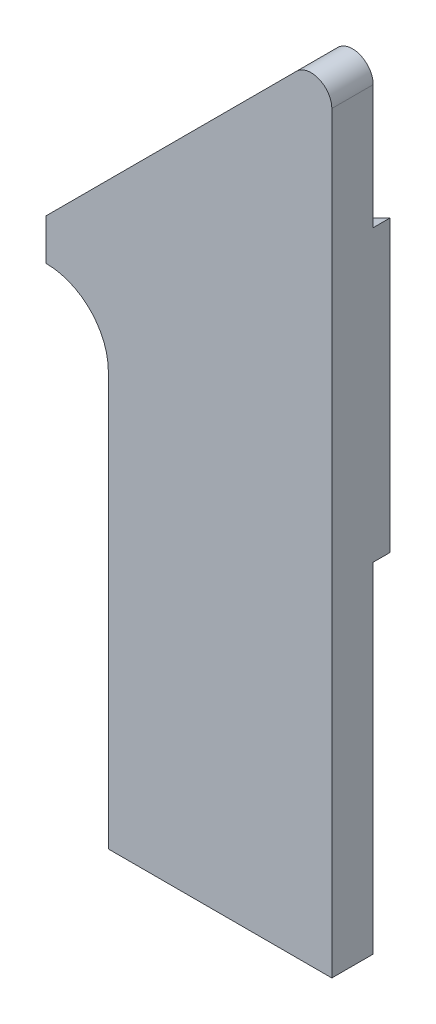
ISO-10303-21;
HEADER;
FILE_DESCRIPTION(('STEP AP214'),'2;1');
FILE_NAME('part.step','',(''),(''),'','','');
FILE_SCHEMA(('AUTOMOTIVE_DESIGN { 1 0 10303 214 1 1 1 1 }'));
ENDSEC;
DATA;
#1=APPLICATION_CONTEXT('core data for automotive mechanical design processes');
#2=APPLICATION_PROTOCOL_DEFINITION('international standard','automotive_design',2000,#1);
#3=PRODUCT_CONTEXT('',#1,'mechanical');
#4=PRODUCT('Part','Part','',(#3));
#5=PRODUCT_RELATED_PRODUCT_CATEGORY('part','',(#4));
#6=PRODUCT_DEFINITION_FORMATION('','',#4);
#7=PRODUCT_DEFINITION_CONTEXT('part definition',#1,'design');
#8=PRODUCT_DEFINITION('design','',#6,#7);
#9=PRODUCT_DEFINITION_SHAPE('','',#8);
#10=(LENGTH_UNIT() NAMED_UNIT(*) SI_UNIT(.MILLI.,.METRE.));
#11=(NAMED_UNIT(*) PLANE_ANGLE_UNIT() SI_UNIT($,.RADIAN.));
#12=(NAMED_UNIT(*) SI_UNIT($,.STERADIAN.) SOLID_ANGLE_UNIT());
#13=UNCERTAINTY_MEASURE_WITH_UNIT(LENGTH_MEASURE(1.E-05),#10,'distance_accuracy_value','');
#14=(GEOMETRIC_REPRESENTATION_CONTEXT(3) GLOBAL_UNCERTAINTY_ASSIGNED_CONTEXT((#13)) GLOBAL_UNIT_ASSIGNED_CONTEXT((#10,
#11,#12)) REPRESENTATION_CONTEXT('',''));
#15=CARTESIAN_POINT('',(0.,0.,0.));
#16=DIRECTION('',(0.,0.,1.));
#17=DIRECTION('',(1.,0.,0.));
#18=AXIS2_PLACEMENT_3D('',#15,#16,#17);
#19=CARTESIAN_POINT('',(0.,0.,0.));
#20=DIRECTION('',(0.,0.,1.));
#21=DIRECTION('',(1.,0.,0.));
#22=AXIS2_PLACEMENT_3D('',#19,#20,#21);
#23=PLANE('',#22);
#24=DIRECTION('',(-1.,0.,0.));
#25=VECTOR('',#24,1.);
#26=CARTESIAN_POINT('',(27.,-8.00000000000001,0.));
#27=LINE('',#26,#25);
#28=CARTESIAN_POINT('',(26.9999999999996,-8.00000000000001,0.));
#29=VERTEX_POINT('',#28);
#30=CARTESIAN_POINT('',(-27.,-8.00000000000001,0.));
#31=VERTEX_POINT('',#30);
#32=EDGE_CURVE('E246',#29,#31,#27,.T.);
#33=ORIENTED_EDGE('',*,*,#32,.F.);
#34=DIRECTION('',(0.,1.,0.));
#35=VECTOR('',#34,1.);
#36=CARTESIAN_POINT('',(26.9999999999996,103.999999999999,0.));
#37=LINE('',#36,#35);
#38=CARTESIAN_POINT('',(27.,-90.,0.));
#39=VERTEX_POINT('',#38);
#40=EDGE_CURVE('E149',#39,#29,#37,.T.);
#41=ORIENTED_EDGE('',*,*,#40,.F.);
#42=DIRECTION('',(1.,0.,0.));
#43=VECTOR('',#42,1.);
#44=CARTESIAN_POINT('',(27.,-90.,0.));
#45=LINE('',#44,#43);
#46=CARTESIAN_POINT('',(-27.,-90.,0.));
#47=VERTEX_POINT('',#46);
#48=EDGE_CURVE('E164',#47,#39,#45,.T.);
#49=ORIENTED_EDGE('',*,*,#48,.F.);
#50=DIRECTION('',(0.,-1.,0.));
#51=VECTOR('',#50,1.);
#52=CARTESIAN_POINT('',(-27.,-90.,0.));
#53=LINE('',#52,#51);
#54=EDGE_CURVE('E185',#31,#47,#53,.T.);
#55=ORIENTED_EDGE('',*,*,#54,.F.);
#56=EDGE_LOOP('',(#33,#41,#49,#55));
#57=FACE_BOUND('',#56,.T.);
#58=ADVANCED_FACE('F39',(#57),#23,.F.);
#59=DIRECTION('',(-0.707106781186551,-0.707106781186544,0.));
#60=VECTOR('',#59,1.);
#61=CARTESIAN_POINT('',(-42.,35.,0.));
#62=LINE('',#61,#60);
#63=CARTESIAN_POINT('',(18.4644660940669,95.4644660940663,0.));
#64=VERTEX_POINT('',#63);
#65=CARTESIAN_POINT('',(-42.,35.,0.));
#66=VERTEX_POINT('',#65);
#67=EDGE_CURVE('E178',#64,#66,#62,.T.);
#68=ORIENTED_EDGE('',*,*,#67,.F.);
#69=CARTESIAN_POINT('',(21.9999999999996,91.9289321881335,0.));
#70=DIRECTION('',(0.,0.,1.));
#71=DIRECTION('',(1.,0.,0.));
#72=AXIS2_PLACEMENT_3D('',#69,#70,#71);
#73=CIRCLE('',#72,5.);
#74=CARTESIAN_POINT('',(26.9999999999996,91.9289321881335,0.));
#75=VERTEX_POINT('',#74);
#76=EDGE_CURVE('E62',#64,#75,#73,.F.);
#77=ORIENTED_EDGE('',*,*,#76,.T.);
#78=CARTESIAN_POINT('',(27.,62.,0.));
#79=VERTEX_POINT('',#78);
#80=EDGE_CURVE('E151',#79,#75,#37,.T.);
#81=ORIENTED_EDGE('',*,*,#80,.F.);
#82=DIRECTION('',(0.891827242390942,0.452376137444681,0.));
#83=VECTOR('',#82,1.);
#84=CARTESIAN_POINT('',(-42.,27.,0.));
#85=LINE('',#84,#83);
#86=CARTESIAN_POINT('',(-42.,27.,0.));
#87=VERTEX_POINT('',#86);
#88=EDGE_CURVE('E144',#87,#79,#85,.T.);
#89=ORIENTED_EDGE('',*,*,#88,.F.);
#90=DIRECTION('',(0.,-1.,0.));
#91=VECTOR('',#90,1.);
#92=CARTESIAN_POINT('',(-42.,25.,0.));
#93=LINE('',#92,#91);
#94=EDGE_CURVE('E181',#66,#87,#93,.T.);
#95=ORIENTED_EDGE('',*,*,#94,.F.);
#96=EDGE_LOOP('',(#68,#77,#81,#89,#95));
#97=FACE_BOUND('',#96,.T.);
#98=ADVANCED_FACE('F229',(#97),#23,.F.);
#99=CARTESIAN_POINT('',(26.9999999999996,103.999999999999,10.));
#100=DIRECTION('',(-1.,0.,0.));
#101=DIRECTION('',(0.,0.,1.));
#102=AXIS2_PLACEMENT_3D('',#99,#100,#101);
#103=PLANE('',#102);
#104=ORIENTED_EDGE('',*,*,#80,.T.);
#105=DIRECTION('',(0.,0.,-1.));
#106=VECTOR('',#105,1.);
#107=CARTESIAN_POINT('',(26.9999999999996,91.9289321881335,10.));
#108=LINE('',#107,#106);
#109=CARTESIAN_POINT('',(26.9999999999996,91.9289321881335,10.));
#110=VERTEX_POINT('',#109);
#111=EDGE_CURVE('E48',#75,#110,#108,.F.);
#112=ORIENTED_EDGE('',*,*,#111,.T.);
#113=DIRECTION('',(0.,1.,0.));
#114=VECTOR('',#113,1.);
#115=CARTESIAN_POINT('',(27.,-90.,10.));
#116=LINE('',#115,#114);
#117=CARTESIAN_POINT('',(27.,-90.,10.));
#118=VERTEX_POINT('',#117);
#119=EDGE_CURVE('E160',#118,#110,#116,.T.);
#120=ORIENTED_EDGE('',*,*,#119,.F.);
#121=DIRECTION('',(0.,0.,-1.));
#122=VECTOR('',#121,1.);
#123=CARTESIAN_POINT('',(27.,-90.,10.));
#124=LINE('',#123,#122);
#125=EDGE_CURVE('E175',#118,#39,#124,.T.);
#126=ORIENTED_EDGE('',*,*,#125,.T.);
#127=ORIENTED_EDGE('',*,*,#40,.T.);
#128=DIRECTION('',(0.,0.,1.));
#129=VECTOR('',#128,1.);
#130=CARTESIAN_POINT('',(27.,-8.00000000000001,-4.));
#131=LINE('',#130,#129);
#132=CARTESIAN_POINT('',(27.,-8.00000000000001,-4.));
#133=VERTEX_POINT('',#132);
#134=EDGE_CURVE('E127',#133,#29,#131,.T.);
#135=ORIENTED_EDGE('',*,*,#134,.F.);
#136=DIRECTION('',(0.,-1.,0.));
#137=VECTOR('',#136,1.);
#138=CARTESIAN_POINT('',(27.,-8.00000000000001,-4.));
#139=LINE('',#138,#137);
#140=CARTESIAN_POINT('',(27.,62.,-4.));
#141=VERTEX_POINT('',#140);
#142=EDGE_CURVE('E135',#141,#133,#139,.T.);
#143=ORIENTED_EDGE('',*,*,#142,.F.);
#144=DIRECTION('',(0.,0.,1.));
#145=VECTOR('',#144,1.);
#146=CARTESIAN_POINT('',(27.,62.,-4.));
#147=LINE('',#146,#145);
#148=EDGE_CURVE('E240',#141,#79,#147,.T.);
#149=ORIENTED_EDGE('',*,*,#148,.T.);
#150=EDGE_LOOP('',(#104,#112,#120,#126,#127,#135,#143,#149));
#151=FACE_BOUND('',#150,.T.);
#152=ADVANCED_FACE('F147',(#151),#103,.F.);
#153=CARTESIAN_POINT('',(-42.,35.,10.));
#154=DIRECTION('',(0.707106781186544,-0.707106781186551,0.));
#155=DIRECTION('',(0.707106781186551,0.707106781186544,0.));
#156=AXIS2_PLACEMENT_3D('',#153,#154,#155);
#157=PLANE('',#156);
#158=DIRECTION('',(-0.707106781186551,-0.707106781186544,0.));
#159=VECTOR('',#158,1.);
#160=CARTESIAN_POINT('',(-42.,35.,10.));
#161=LINE('',#160,#159);
#162=CARTESIAN_POINT('',(18.4644660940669,95.4644660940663,10.));
#163=VERTEX_POINT('',#162);
#164=CARTESIAN_POINT('',(-42.,35.,10.));
#165=VERTEX_POINT('',#164);
#166=EDGE_CURVE('E163',#163,#165,#161,.T.);
#167=ORIENTED_EDGE('',*,*,#166,.F.);
#168=DIRECTION('',(0.,0.,-1.));
#169=VECTOR('',#168,1.);
#170=CARTESIAN_POINT('',(18.4644660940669,95.4644660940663,10.));
#171=LINE('',#170,#169);
#172=EDGE_CURVE('E215',#163,#64,#171,.T.);
#173=ORIENTED_EDGE('',*,*,#172,.T.);
#174=ORIENTED_EDGE('',*,*,#67,.T.);
#175=DIRECTION('',(0.,0.,-1.));
#176=VECTOR('',#175,1.);
#177=CARTESIAN_POINT('',(-42.,35.,10.));
#178=LINE('',#177,#176);
#179=EDGE_CURVE('E201',#165,#66,#178,.T.);
#180=ORIENTED_EDGE('',*,*,#179,.F.);
#181=EDGE_LOOP('',(#167,#173,#174,#180));
#182=FACE_BOUND('',#181,.T.);
#183=ADVANCED_FACE('F224',(#182),#157,.F.);
#184=CARTESIAN_POINT('',(-42.,25.,10.));
#185=DIRECTION('',(1.,0.,0.));
#186=DIRECTION('',(0.,1.,0.));
#187=AXIS2_PLACEMENT_3D('',#184,#185,#186);
#188=PLANE('',#187);
#189=ORIENTED_EDGE('',*,*,#94,.T.);
#190=DIRECTION('',(0.,0.,1.));
#191=VECTOR('',#190,1.);
#192=CARTESIAN_POINT('',(-42.,27.,-4.));
#193=LINE('',#192,#191);
#194=CARTESIAN_POINT('',(-42.,27.,-4.));
#195=VERTEX_POINT('',#194);
#196=EDGE_CURVE('E156',#195,#87,#193,.T.);
#197=ORIENTED_EDGE('',*,*,#196,.F.);
#198=DIRECTION('',(0.,1.,0.));
#199=VECTOR('',#198,1.);
#200=CARTESIAN_POINT('',(-42.,25.,-4.));
#201=LINE('',#200,#199);
#202=CARTESIAN_POINT('',(-42.,25.,-4.));
#203=VERTEX_POINT('',#202);
#204=EDGE_CURVE('E251',#203,#195,#201,.T.);
#205=ORIENTED_EDGE('',*,*,#204,.F.);
#206=DIRECTION('',(0.,0.,-1.));
#207=VECTOR('',#206,1.);
#208=CARTESIAN_POINT('',(-42.,25.,10.));
#209=LINE('',#208,#207);
#210=CARTESIAN_POINT('',(-42.,25.,10.));
#211=VERTEX_POINT('',#210);
#212=EDGE_CURVE('E197',#211,#203,#209,.T.);
#213=ORIENTED_EDGE('',*,*,#212,.F.);
#214=DIRECTION('',(0.,-1.,0.));
#215=VECTOR('',#214,1.);
#216=CARTESIAN_POINT('',(-42.,25.,10.));
#217=LINE('',#216,#215);
#218=EDGE_CURVE('E167',#165,#211,#217,.T.);
#219=ORIENTED_EDGE('',*,*,#218,.F.);
#220=ORIENTED_EDGE('',*,*,#179,.T.);
#221=EDGE_LOOP('',(#189,#197,#205,#213,#219,#220));
#222=FACE_BOUND('',#221,.T.);
#223=ADVANCED_FACE('F234',(#222),#188,.F.);
#224=CARTESIAN_POINT('',(-27.,-90.,10.));
#225=DIRECTION('',(1.,0.,0.));
#226=DIRECTION('',(0.,0.,-1.));
#227=AXIS2_PLACEMENT_3D('',#224,#225,#226);
#228=PLANE('',#227);
#229=DIRECTION('',(0.,-1.,0.));
#230=VECTOR('',#229,1.);
#231=CARTESIAN_POINT('',(-27.,-90.,10.));
#232=LINE('',#231,#230);
#233=CARTESIAN_POINT('',(-27.,9.99999999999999,10.));
#234=VERTEX_POINT('',#233);
#235=CARTESIAN_POINT('',(-27.,-90.,10.));
#236=VERTEX_POINT('',#235);
#237=EDGE_CURVE('E170',#234,#236,#232,.T.);
#238=ORIENTED_EDGE('',*,*,#237,.F.);
#239=DIRECTION('',(0.,0.,-1.));
#240=VECTOR('',#239,1.);
#241=CARTESIAN_POINT('',(-27.,9.99999999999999,-4.));
#242=LINE('',#241,#240);
#243=CARTESIAN_POINT('',(-27.,9.99999999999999,-4.));
#244=VERTEX_POINT('',#243);
#245=EDGE_CURVE('E205',#234,#244,#242,.T.);
#246=ORIENTED_EDGE('',*,*,#245,.T.);
#247=DIRECTION('',(0.,1.,0.));
#248=VECTOR('',#247,1.);
#249=CARTESIAN_POINT('',(-27.,-8.00000000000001,-4.));
#250=LINE('',#249,#248);
#251=CARTESIAN_POINT('',(-27.,-8.00000000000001,-4.));
#252=VERTEX_POINT('',#251);
#253=EDGE_CURVE('E134',#252,#244,#250,.T.);
#254=ORIENTED_EDGE('',*,*,#253,.F.);
#255=DIRECTION('',(0.,0.,1.));
#256=VECTOR('',#255,1.);
#257=CARTESIAN_POINT('',(-27.,-8.00000000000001,-4.));
#258=LINE('',#257,#256);
#259=EDGE_CURVE('E129',#252,#31,#258,.T.);
#260=ORIENTED_EDGE('',*,*,#259,.T.);
#261=ORIENTED_EDGE('',*,*,#54,.T.);
#262=DIRECTION('',(0.,0.,-1.));
#263=VECTOR('',#262,1.);
#264=CARTESIAN_POINT('',(-27.,-90.,10.));
#265=LINE('',#264,#263);
#266=EDGE_CURVE('E193',#236,#47,#265,.T.);
#267=ORIENTED_EDGE('',*,*,#266,.F.);
#268=EDGE_LOOP('',(#238,#246,#254,#260,#261,#267));
#269=FACE_BOUND('',#268,.T.);
#270=ADVANCED_FACE('F257',(#269),#228,.F.);
#271=CARTESIAN_POINT('',(27.,-90.,10.));
#272=DIRECTION('',(0.,1.,0.));
#273=DIRECTION('',(-1.,0.,0.));
#274=AXIS2_PLACEMENT_3D('',#271,#272,#273);
#275=PLANE('',#274);
#276=ORIENTED_EDGE('',*,*,#48,.T.);
#277=ORIENTED_EDGE('',*,*,#125,.F.);
#278=DIRECTION('',(1.,0.,0.));
#279=VECTOR('',#278,1.);
#280=CARTESIAN_POINT('',(27.,-90.,10.));
#281=LINE('',#280,#279);
#282=EDGE_CURVE('E173',#236,#118,#281,.T.);
#283=ORIENTED_EDGE('',*,*,#282,.F.);
#284=ORIENTED_EDGE('',*,*,#266,.T.);
#285=EDGE_LOOP('',(#276,#277,#283,#284));
#286=FACE_BOUND('',#285,.T.);
#287=ADVANCED_FACE('F279',(#286),#275,.F.);
#288=CARTESIAN_POINT('',(0.,0.,10.));
#289=DIRECTION('',(0.,0.,1.));
#290=DIRECTION('',(1.,0.,0.));
#291=AXIS2_PLACEMENT_3D('',#288,#289,#290);
#292=PLANE('',#291);
#293=ORIENTED_EDGE('',*,*,#119,.T.);
#294=CARTESIAN_POINT('',(21.9999999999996,91.9289321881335,10.));
#295=DIRECTION('',(0.,0.,1.));
#296=DIRECTION('',(1.,0.,0.));
#297=AXIS2_PLACEMENT_3D('',#294,#295,#296);
#298=CIRCLE('',#297,5.);
#299=EDGE_CURVE('E11',#110,#163,#298,.T.);
#300=ORIENTED_EDGE('',*,*,#299,.T.);
#301=ORIENTED_EDGE('',*,*,#166,.T.);
#302=ORIENTED_EDGE('',*,*,#218,.T.);
#303=CARTESIAN_POINT('',(-42.,9.99999999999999,10.));
#304=DIRECTION('',(0.,0.,1.));
#305=DIRECTION('',(1.,0.,0.));
#306=AXIS2_PLACEMENT_3D('',#303,#304,#305);
#307=CIRCLE('',#306,15.);
#308=EDGE_CURVE('E212',#211,#234,#307,.F.);
#309=ORIENTED_EDGE('',*,*,#308,.T.);
#310=ORIENTED_EDGE('',*,*,#237,.T.);
#311=ORIENTED_EDGE('',*,*,#282,.T.);
#312=EDGE_LOOP('',(#293,#300,#301,#302,#309,#310,#311));
#313=FACE_BOUND('',#312,.T.);
#314=ADVANCED_FACE('F265',(#313),#292,.T.);
#315=CARTESIAN_POINT('',(27.,-8.00000000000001,-4.));
#316=DIRECTION('',(0.,1.,0.));
#317=DIRECTION('',(0.,0.,1.));
#318=AXIS2_PLACEMENT_3D('',#315,#316,#317);
#319=PLANE('',#318);
#320=ORIENTED_EDGE('',*,*,#32,.T.);
#321=ORIENTED_EDGE('',*,*,#259,.F.);
#322=DIRECTION('',(-1.,0.,0.));
#323=VECTOR('',#322,1.);
#324=CARTESIAN_POINT('',(27.,-8.00000000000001,-4.));
#325=LINE('',#324,#323);
#326=EDGE_CURVE('E122',#133,#252,#325,.T.);
#327=ORIENTED_EDGE('',*,*,#326,.F.);
#328=ORIENTED_EDGE('',*,*,#134,.T.);
#329=EDGE_LOOP('',(#320,#321,#327,#328));
#330=FACE_BOUND('',#329,.T.);
#331=ADVANCED_FACE('F125',(#330),#319,.F.);
#332=CARTESIAN_POINT('',(-42.,27.,-4.));
#333=DIRECTION('',(0.452376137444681,-0.891827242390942,0.));
#334=DIRECTION('',(0.891827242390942,0.452376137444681,0.));
#335=AXIS2_PLACEMENT_3D('',#332,#333,#334);
#336=PLANE('',#335);
#337=ORIENTED_EDGE('',*,*,#88,.T.);
#338=ORIENTED_EDGE('',*,*,#148,.F.);
#339=DIRECTION('',(0.891827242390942,0.452376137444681,0.));
#340=VECTOR('',#339,1.);
#341=CARTESIAN_POINT('',(-42.,27.,-4.));
#342=LINE('',#341,#340);
#343=EDGE_CURVE('E140',#195,#141,#342,.T.);
#344=ORIENTED_EDGE('',*,*,#343,.F.);
#345=ORIENTED_EDGE('',*,*,#196,.T.);
#346=EDGE_LOOP('',(#337,#338,#344,#345));
#347=FACE_BOUND('',#346,.T.);
#348=ADVANCED_FACE('F238',(#347),#336,.F.);
#349=CARTESIAN_POINT('',(0.,0.,-4.));
#350=DIRECTION('',(0.,0.,1.));
#351=DIRECTION('',(1.,0.,0.));
#352=AXIS2_PLACEMENT_3D('',#349,#350,#351);
#353=PLANE('',#352);
#354=ORIENTED_EDGE('',*,*,#142,.T.);
#355=ORIENTED_EDGE('',*,*,#326,.T.);
#356=ORIENTED_EDGE('',*,*,#253,.T.);
#357=CARTESIAN_POINT('',(-42.,9.99999999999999,-4.));
#358=DIRECTION('',(0.,0.,1.));
#359=DIRECTION('',(1.,0.,0.));
#360=AXIS2_PLACEMENT_3D('',#357,#358,#359);
#361=CIRCLE('',#360,15.);
#362=EDGE_CURVE('E209',#244,#203,#361,.T.);
#363=ORIENTED_EDGE('',*,*,#362,.T.);
#364=ORIENTED_EDGE('',*,*,#204,.T.);
#365=ORIENTED_EDGE('',*,*,#343,.T.);
#366=EDGE_LOOP('',(#354,#355,#356,#363,#364,#365));
#367=FACE_BOUND('',#366,.T.);
#368=ADVANCED_FACE('F138',(#367),#353,.F.);
#369=CARTESIAN_POINT('',(-42.,9.99999999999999,10.));
#370=DIRECTION('',(0.,0.,1.));
#371=DIRECTION('',(1.,0.,0.));
#372=AXIS2_PLACEMENT_3D('',#369,#370,#371);
#373=CYLINDRICAL_SURFACE('',#372,15.);
#374=ORIENTED_EDGE('',*,*,#308,.F.);
#375=ORIENTED_EDGE('',*,*,#212,.T.);
#376=ORIENTED_EDGE('',*,*,#362,.F.);
#377=ORIENTED_EDGE('',*,*,#245,.F.);
#378=EDGE_LOOP('',(#374,#375,#376,#377));
#379=FACE_BOUND('',#378,.T.);
#380=ADVANCED_FACE('F262',(#379),#373,.F.);
#381=CARTESIAN_POINT('',(21.9999999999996,91.9289321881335,10.));
#382=DIRECTION('',(0.,0.,-1.));
#383=DIRECTION('',(-1.,0.,0.));
#384=AXIS2_PLACEMENT_3D('',#381,#382,#383);
#385=CYLINDRICAL_SURFACE('',#384,5.);
#386=ORIENTED_EDGE('',*,*,#299,.F.);
#387=ORIENTED_EDGE('',*,*,#111,.F.);
#388=ORIENTED_EDGE('',*,*,#76,.F.);
#389=ORIENTED_EDGE('',*,*,#172,.F.);
#390=EDGE_LOOP('',(#386,#387,#388,#389));
#391=FACE_BOUND('',#390,.T.);
#392=ADVANCED_FACE('F41',(#391),#385,.T.);
#393=CLOSED_SHELL('',(#58,#98,#152,#183,#223,#270,#287,#314,#331,#348,#368,#380,#392));
#394=MANIFOLD_SOLID_BREP('B2',#393);
#395=ADVANCED_BREP_SHAPE_REPRESENTATION('',(#18,#394),#14);
#396=SHAPE_DEFINITION_REPRESENTATION(#9,#395);
ENDSEC;
END-ISO-10303-21;
